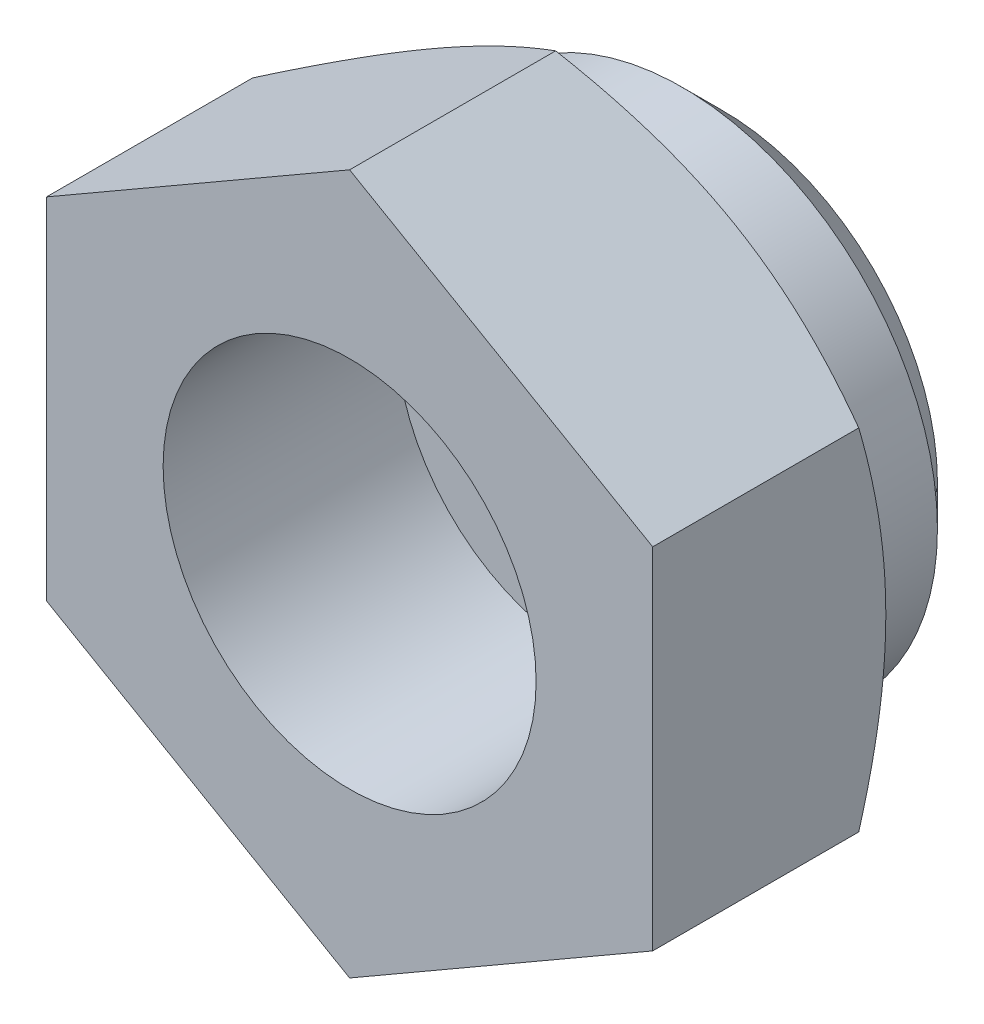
from build123d import *

# Parameters (mm, degrees)
BASE_EXTRUSION_DEPTH    = 7
ESQUISSE3_R             = 4
ENL_V_MAT_EXTRU_1_DEPTH = 7
ESQUISSE5_R             = 7.828367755
ENL_V_MAT_EXTRU_2_DEPTH = 2


with BuildPart() as part:
    # Esquisse1 → Base-Extrusion (new body)
    with BuildSketch(Plane.XY):
        Polygon((6.5, -3.75277675), (6.5, 3.75277675), (0, 7.505553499), (-6.5, 3.75277675), (-6.5, -3.75277675), (0, -7.505553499), align=None)
    extrude(amount=-BASE_EXTRUSION_DEPTH)

    # Esquisse2 → Enl_vement de mati_re-R_volution1 (revolve, cut)
    with BuildSketch(Plane(origin=(0, 0, 0), x_dir=(1, 0, 0), z_dir=(0, 1, 0))):
        Polygon((-6.5, 0), (-13.562177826, 0), (-13.562177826, 7), (-6.5, 7), (-12.562177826, 3.5), align=None)
    revolve(axis=Axis((0, 0, -7), (0, 0, 1)), mode=Mode.SUBTRACT)

    # Esquisse4 → Boss.-R_vol.1 (revolve)
    with BuildSketch(Plane(origin=(0, 0, 0), x_dir=(1, 0, 0), z_dir=(0, 1, 0)), mode=Mode.PRIVATE) as boss_r_vol_1_sk:
        Polygon((0, 9.569026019), (0, 7), (-5.469553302, 7), (-5.469553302, 9.138052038), (-4.607605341, 10), (-1.198992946, 10), (-0.768018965, 9.569026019), align=None)
    revolve(boss_r_vol_1_sk.sketch.rotate(Axis((0, 0, 0), (0, 0, -1)), 180), axis=Axis((0, 0, 0), (0, 0, -1)))

    # Esquisse3 → Enl_v. mat.-Extru.1 (cut)
    with BuildSketch(Plane.XY):
        Circle(ESQUISSE3_R)
    extrude(amount=-ENL_V_MAT_EXTRU_1_DEPTH, mode=Mode.SUBTRACT)

    # Esquisse5 → Enl_v. mat.-Extru.2 (cut)
    with BuildSketch(Plane.XY):
        Circle(ESQUISSE5_R)
    extrude(amount=-ENL_V_MAT_EXTRU_2_DEPTH, mode=Mode.SUBTRACT)


solid = part.part
